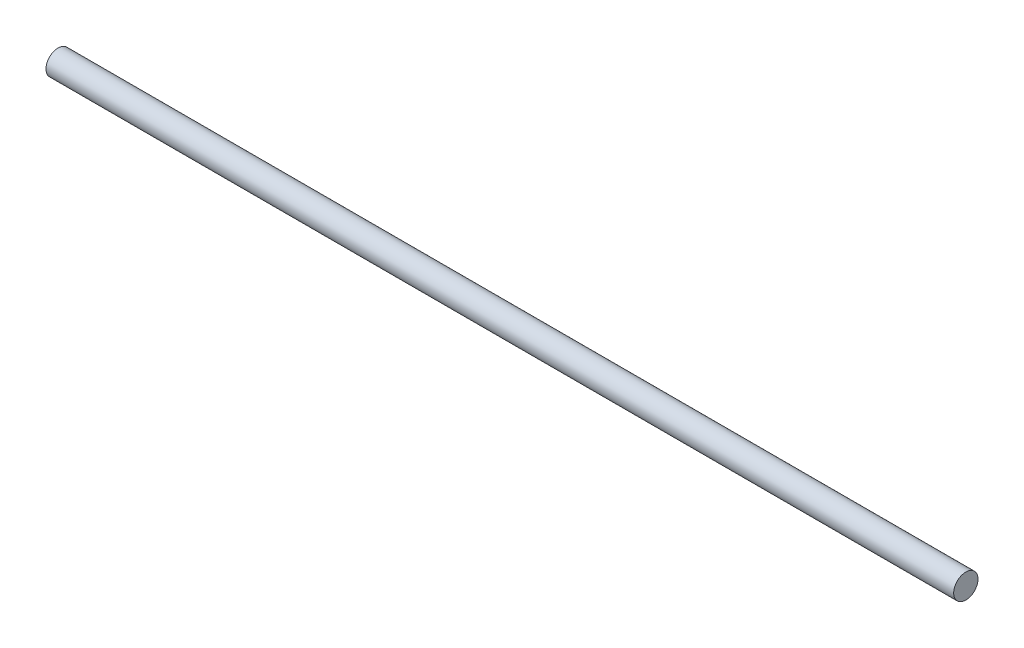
ISO-10303-21;
HEADER;
FILE_DESCRIPTION(('STEP AP214'),'2;1');
FILE_NAME('part.step','',(''),(''),'','','');
FILE_SCHEMA(('AUTOMOTIVE_DESIGN { 1 0 10303 214 1 1 1 1 }'));
ENDSEC;
DATA;
#1=APPLICATION_CONTEXT('core data for automotive mechanical design processes');
#2=APPLICATION_PROTOCOL_DEFINITION('international standard','automotive_design',2000,#1);
#3=PRODUCT_CONTEXT('',#1,'mechanical');
#4=PRODUCT('Part','Part','',(#3));
#5=PRODUCT_RELATED_PRODUCT_CATEGORY('part','',(#4));
#6=PRODUCT_DEFINITION_FORMATION('','',#4);
#7=PRODUCT_DEFINITION_CONTEXT('part definition',#1,'design');
#8=PRODUCT_DEFINITION('design','',#6,#7);
#9=PRODUCT_DEFINITION_SHAPE('','',#8);
#10=(LENGTH_UNIT() NAMED_UNIT(*) SI_UNIT(.MILLI.,.METRE.));
#11=(NAMED_UNIT(*) PLANE_ANGLE_UNIT() SI_UNIT($,.RADIAN.));
#12=(NAMED_UNIT(*) SI_UNIT($,.STERADIAN.) SOLID_ANGLE_UNIT());
#13=UNCERTAINTY_MEASURE_WITH_UNIT(LENGTH_MEASURE(1.E-05),#10,'distance_accuracy_value','');
#14=(GEOMETRIC_REPRESENTATION_CONTEXT(3) GLOBAL_UNCERTAINTY_ASSIGNED_CONTEXT((#13)) GLOBAL_UNIT_ASSIGNED_CONTEXT((#10,
#11,#12)) REPRESENTATION_CONTEXT('',''));
#15=CARTESIAN_POINT('',(0.,0.,0.));
#16=DIRECTION('',(0.,0.,1.));
#17=DIRECTION('',(1.,0.,0.));
#18=AXIS2_PLACEMENT_3D('',#15,#16,#17);
#19=CARTESIAN_POINT('',(149.225,0.,0.));
#20=DIRECTION('',(-1.,0.,0.));
#21=DIRECTION('',(0.,0.,1.));
#22=AXIS2_PLACEMENT_3D('',#19,#20,#21);
#23=CYLINDRICAL_SURFACE('',#22,2.);
#24=CARTESIAN_POINT('',(149.225,0.,0.));
#25=DIRECTION('',(1.,0.,0.));
#26=DIRECTION('',(0.,0.,-1.));
#27=AXIS2_PLACEMENT_3D('',#24,#25,#26);
#28=CIRCLE('',#27,2.);
#29=CARTESIAN_POINT('',(149.225,0.,-2.));
#30=VERTEX_POINT('',#29);
#31=EDGE_CURVE('E10',#30,#30,#28,.T.);
#32=ORIENTED_EDGE('',*,*,#31,.F.);
#33=EDGE_LOOP('',(#32));
#34=FACE_BOUND('',#33,.T.);
#35=CARTESIAN_POINT('',(0.,0.,0.));
#36=DIRECTION('',(1.,0.,0.));
#37=DIRECTION('',(0.,0.,-1.));
#38=AXIS2_PLACEMENT_3D('',#35,#36,#37);
#39=CIRCLE('',#38,2.);
#40=CARTESIAN_POINT('',(0.,0.,-2.));
#41=VERTEX_POINT('',#40);
#42=EDGE_CURVE('E40',#41,#41,#39,.T.);
#43=ORIENTED_EDGE('',*,*,#42,.T.);
#44=EDGE_LOOP('',(#43));
#45=FACE_BOUND('',#44,.T.);
#46=ADVANCED_FACE('F37',(#34,#45),#23,.T.);
#47=CARTESIAN_POINT('',(149.225,0.,0.));
#48=DIRECTION('',(1.,0.,0.));
#49=DIRECTION('',(0.,0.,-1.));
#50=AXIS2_PLACEMENT_3D('',#47,#48,#49);
#51=PLANE('',#50);
#52=ORIENTED_EDGE('',*,*,#31,.T.);
#53=EDGE_LOOP('',(#52));
#54=FACE_BOUND('',#53,.T.);
#55=ADVANCED_FACE('F52',(#54),#51,.T.);
#56=CARTESIAN_POINT('',(0.,0.,0.));
#57=DIRECTION('',(1.,0.,0.));
#58=DIRECTION('',(0.,0.,-1.));
#59=AXIS2_PLACEMENT_3D('',#56,#57,#58);
#60=PLANE('',#59);
#61=ORIENTED_EDGE('',*,*,#42,.F.);
#62=EDGE_LOOP('',(#61));
#63=FACE_BOUND('',#62,.T.);
#64=ADVANCED_FACE('F50',(#63),#60,.F.);
#65=CLOSED_SHELL('',(#46,#55,#64));
#66=MANIFOLD_SOLID_BREP('B2',#65);
#67=ADVANCED_BREP_SHAPE_REPRESENTATION('',(#18,#66),#14);
#68=SHAPE_DEFINITION_REPRESENTATION(#9,#67);
ENDSEC;
END-ISO-10303-21;
